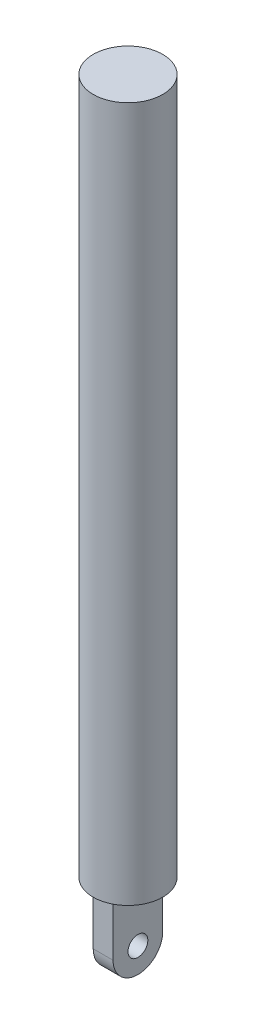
ISO-10303-21;
HEADER;
FILE_DESCRIPTION(('STEP AP214'),'2;1');
FILE_NAME('part.step','',(''),(''),'','','');
FILE_SCHEMA(('AUTOMOTIVE_DESIGN { 1 0 10303 214 1 1 1 1 }'));
ENDSEC;
DATA;
#1=APPLICATION_CONTEXT('core data for automotive mechanical design processes');
#2=APPLICATION_PROTOCOL_DEFINITION('international standard','automotive_design',2000,#1);
#3=PRODUCT_CONTEXT('',#1,'mechanical');
#4=PRODUCT('Part','Part','',(#3));
#5=PRODUCT_RELATED_PRODUCT_CATEGORY('part','',(#4));
#6=PRODUCT_DEFINITION_FORMATION('','',#4);
#7=PRODUCT_DEFINITION_CONTEXT('part definition',#1,'design');
#8=PRODUCT_DEFINITION('design','',#6,#7);
#9=PRODUCT_DEFINITION_SHAPE('','',#8);
#10=(LENGTH_UNIT() NAMED_UNIT(*) SI_UNIT(.MILLI.,.METRE.));
#11=(NAMED_UNIT(*) PLANE_ANGLE_UNIT() SI_UNIT($,.RADIAN.));
#12=(NAMED_UNIT(*) SI_UNIT($,.STERADIAN.) SOLID_ANGLE_UNIT());
#13=UNCERTAINTY_MEASURE_WITH_UNIT(LENGTH_MEASURE(1.E-05),#10,'distance_accuracy_value','');
#14=(GEOMETRIC_REPRESENTATION_CONTEXT(3) GLOBAL_UNCERTAINTY_ASSIGNED_CONTEXT((#13)) GLOBAL_UNIT_ASSIGNED_CONTEXT((#10,
#11,#12)) REPRESENTATION_CONTEXT('',''));
#15=CARTESIAN_POINT('',(0.,0.,0.));
#16=DIRECTION('',(0.,0.,1.));
#17=DIRECTION('',(1.,0.,0.));
#18=AXIS2_PLACEMENT_3D('',#15,#16,#17);
#19=CARTESIAN_POINT('',(0.,0.,0.));
#20=DIRECTION('',(0.,1.,0.));
#21=DIRECTION('',(0.,0.,1.));
#22=AXIS2_PLACEMENT_3D('',#19,#20,#21);
#23=PLANE('',#22);
#24=CARTESIAN_POINT('',(0.,0.,0.));
#25=DIRECTION('',(0.,1.,0.));
#26=DIRECTION('',(0.,0.,1.));
#27=AXIS2_PLACEMENT_3D('',#24,#25,#26);
#28=CIRCLE('',#27,35.);
#29=CARTESIAN_POINT('',(0.,0.,35.));
#30=VERTEX_POINT('',#29);
#31=EDGE_CURVE('E102',#30,#30,#28,.T.);
#32=ORIENTED_EDGE('',*,*,#31,.F.);
#33=EDGE_LOOP('',(#32));
#34=FACE_BOUND('',#33,.T.);
#35=DIRECTION('',(-1.,0.,0.));
#36=VECTOR('',#35,1.);
#37=CARTESIAN_POINT('',(-9.99999999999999,0.,25.));
#38=LINE('',#37,#36);
#39=CARTESIAN_POINT('',(10.,0.,25.));
#40=VERTEX_POINT('',#39);
#41=CARTESIAN_POINT('',(-9.99999999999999,0.,25.));
#42=VERTEX_POINT('',#41);
#43=EDGE_CURVE('E88',#40,#42,#38,.T.);
#44=ORIENTED_EDGE('',*,*,#43,.F.);
#45=DIRECTION('',(0.,0.,-1.));
#46=VECTOR('',#45,1.);
#47=CARTESIAN_POINT('',(10.,0.,25.));
#48=LINE('',#47,#46);
#49=CARTESIAN_POINT('',(10.,0.,-25.));
#50=VERTEX_POINT('',#49);
#51=EDGE_CURVE('E95',#40,#50,#48,.T.);
#52=ORIENTED_EDGE('',*,*,#51,.T.);
#53=DIRECTION('',(-1.,0.,0.));
#54=VECTOR('',#53,1.);
#55=CARTESIAN_POINT('',(-9.99999999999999,0.,-25.));
#56=LINE('',#55,#54);
#57=CARTESIAN_POINT('',(-9.99999999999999,0.,-25.));
#58=VERTEX_POINT('',#57);
#59=EDGE_CURVE('E113',#50,#58,#56,.T.);
#60=ORIENTED_EDGE('',*,*,#59,.T.);
#61=DIRECTION('',(0.,0.,-1.));
#62=VECTOR('',#61,1.);
#63=CARTESIAN_POINT('',(-9.99999999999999,0.,25.));
#64=LINE('',#63,#62);
#65=EDGE_CURVE('E103',#42,#58,#64,.T.);
#66=ORIENTED_EDGE('',*,*,#65,.F.);
#67=EDGE_LOOP('',(#44,#52,#60,#66));
#68=FACE_BOUND('',#67,.T.);
#69=ADVANCED_FACE('F39',(#34,#68),#23,.F.);
#70=CARTESIAN_POINT('',(0.,700.,0.));
#71=DIRECTION('',(0.,-1.,0.));
#72=DIRECTION('',(0.,0.,-1.));
#73=AXIS2_PLACEMENT_3D('',#70,#71,#72);
#74=CYLINDRICAL_SURFACE('',#73,35.);
#75=CARTESIAN_POINT('',(0.,700.,0.));
#76=DIRECTION('',(0.,1.,0.));
#77=DIRECTION('',(0.,0.,1.));
#78=AXIS2_PLACEMENT_3D('',#75,#76,#77);
#79=CIRCLE('',#78,35.);
#80=CARTESIAN_POINT('',(0.,700.,35.));
#81=VERTEX_POINT('',#80);
#82=EDGE_CURVE('E118',#81,#81,#79,.T.);
#83=ORIENTED_EDGE('',*,*,#82,.F.);
#84=EDGE_LOOP('',(#83));
#85=FACE_BOUND('',#84,.T.);
#86=ORIENTED_EDGE('',*,*,#31,.T.);
#87=EDGE_LOOP('',(#86));
#88=FACE_BOUND('',#87,.T.);
#89=ADVANCED_FACE('F155',(#85,#88),#74,.T.);
#90=CARTESIAN_POINT('',(0.,700.,0.));
#91=DIRECTION('',(0.,1.,0.));
#92=DIRECTION('',(0.,0.,1.));
#93=AXIS2_PLACEMENT_3D('',#90,#91,#92);
#94=PLANE('',#93);
#95=ORIENTED_EDGE('',*,*,#82,.T.);
#96=EDGE_LOOP('',(#95));
#97=FACE_BOUND('',#96,.T.);
#98=ADVANCED_FACE('F147',(#97),#94,.T.);
#99=CARTESIAN_POINT('',(10.,-80.,25.));
#100=DIRECTION('',(-1.,0.,0.));
#101=DIRECTION('',(0.,-1.,0.));
#102=AXIS2_PLACEMENT_3D('',#99,#100,#101);
#103=PLANE('',#102);
#104=CARTESIAN_POINT('',(10.,-55.,0.));
#105=DIRECTION('',(1.,0.,0.));
#106=DIRECTION('',(0.,1.,0.));
#107=AXIS2_PLACEMENT_3D('',#104,#105,#106);
#108=CIRCLE('',#107,10.);
#109=CARTESIAN_POINT('',(10.,-45.,0.));
#110=VERTEX_POINT('',#109);
#111=EDGE_CURVE('E136',#110,#110,#108,.T.);
#112=ORIENTED_EDGE('',*,*,#111,.F.);
#113=EDGE_LOOP('',(#112));
#114=FACE_BOUND('',#113,.T.);
#115=CARTESIAN_POINT('',(10.,-55.,0.));
#116=DIRECTION('',(-1.,0.,0.));
#117=DIRECTION('',(0.,-1.,0.));
#118=AXIS2_PLACEMENT_3D('',#115,#116,#117);
#119=CIRCLE('',#118,25.);
#120=CARTESIAN_POINT('',(10.,-55.,25.));
#121=VERTEX_POINT('',#120);
#122=CARTESIAN_POINT('',(10.,-80.,0.));
#123=VERTEX_POINT('',#122);
#124=EDGE_CURVE('E121',#121,#123,#119,.F.);
#125=ORIENTED_EDGE('',*,*,#124,.T.);
#126=CARTESIAN_POINT('',(10.,-55.,0.));
#127=DIRECTION('',(-1.,0.,0.));
#128=DIRECTION('',(0.,-1.,0.));
#129=AXIS2_PLACEMENT_3D('',#126,#127,#128);
#130=CIRCLE('',#129,25.);
#131=CARTESIAN_POINT('',(10.,-55.,-25.));
#132=VERTEX_POINT('',#131);
#133=EDGE_CURVE('E125',#123,#132,#130,.F.);
#134=ORIENTED_EDGE('',*,*,#133,.T.);
#135=DIRECTION('',(0.,1.,0.));
#136=VECTOR('',#135,1.);
#137=CARTESIAN_POINT('',(10.,-80.,-25.));
#138=LINE('',#137,#136);
#139=EDGE_CURVE('E98',#132,#50,#138,.T.);
#140=ORIENTED_EDGE('',*,*,#139,.T.);
#141=ORIENTED_EDGE('',*,*,#51,.F.);
#142=DIRECTION('',(0.,1.,0.));
#143=VECTOR('',#142,1.);
#144=CARTESIAN_POINT('',(10.,-80.,25.));
#145=LINE('',#144,#143);
#146=EDGE_CURVE('E84',#121,#40,#145,.T.);
#147=ORIENTED_EDGE('',*,*,#146,.F.);
#148=EDGE_LOOP('',(#125,#134,#140,#141,#147));
#149=FACE_BOUND('',#148,.T.);
#150=ADVANCED_FACE('F96',(#114,#149),#103,.F.);
#151=CARTESIAN_POINT('',(-9.99999999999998,-80.,25.));
#152=DIRECTION('',(1.,0.,0.));
#153=DIRECTION('',(0.,1.,0.));
#154=AXIS2_PLACEMENT_3D('',#151,#152,#153);
#155=PLANE('',#154);
#156=CARTESIAN_POINT('',(-9.99999999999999,-55.,0.));
#157=DIRECTION('',(1.,0.,0.));
#158=DIRECTION('',(0.,1.,0.));
#159=AXIS2_PLACEMENT_3D('',#156,#157,#158);
#160=CIRCLE('',#159,10.);
#161=CARTESIAN_POINT('',(-9.99999999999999,-45.,0.));
#162=VERTEX_POINT('',#161);
#163=EDGE_CURVE('E43',#162,#162,#160,.T.);
#164=ORIENTED_EDGE('',*,*,#163,.T.);
#165=EDGE_LOOP('',(#164));
#166=FACE_BOUND('',#165,.T.);
#167=DIRECTION('',(0.,-1.,0.));
#168=VECTOR('',#167,1.);
#169=CARTESIAN_POINT('',(-9.99999999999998,-80.,-25.));
#170=LINE('',#169,#168);
#171=CARTESIAN_POINT('',(-9.99999999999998,-55.,-25.));
#172=VERTEX_POINT('',#171);
#173=EDGE_CURVE('E92',#58,#172,#170,.T.);
#174=ORIENTED_EDGE('',*,*,#173,.T.);
#175=CARTESIAN_POINT('',(-9.99999999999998,-55.,0.));
#176=DIRECTION('',(1.,0.,0.));
#177=DIRECTION('',(0.,1.,0.));
#178=AXIS2_PLACEMENT_3D('',#175,#176,#177);
#179=CIRCLE('',#178,25.);
#180=CARTESIAN_POINT('',(-9.99999999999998,-80.,0.));
#181=VERTEX_POINT('',#180);
#182=EDGE_CURVE('E48',#172,#181,#179,.F.);
#183=ORIENTED_EDGE('',*,*,#182,.T.);
#184=CARTESIAN_POINT('',(-9.99999999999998,-55.,0.));
#185=DIRECTION('',(1.,0.,0.));
#186=DIRECTION('',(0.,1.,0.));
#187=AXIS2_PLACEMENT_3D('',#184,#185,#186);
#188=CIRCLE('',#187,25.);
#189=CARTESIAN_POINT('',(-9.99999999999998,-55.,25.));
#190=VERTEX_POINT('',#189);
#191=EDGE_CURVE('E56',#181,#190,#188,.F.);
#192=ORIENTED_EDGE('',*,*,#191,.T.);
#193=DIRECTION('',(0.,-1.,0.));
#194=VECTOR('',#193,1.);
#195=CARTESIAN_POINT('',(-9.99999999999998,-80.,25.));
#196=LINE('',#195,#194);
#197=EDGE_CURVE('E107',#42,#190,#196,.T.);
#198=ORIENTED_EDGE('',*,*,#197,.F.);
#199=ORIENTED_EDGE('',*,*,#65,.T.);
#200=EDGE_LOOP('',(#174,#183,#192,#198,#199));
#201=FACE_BOUND('',#200,.T.);
#202=ADVANCED_FACE('F146',(#166,#201),#155,.F.);
#203=CARTESIAN_POINT('',(0.,0.,25.));
#204=DIRECTION('',(0.,0.,-1.));
#205=DIRECTION('',(-1.,0.,0.));
#206=AXIS2_PLACEMENT_3D('',#203,#204,#205);
#207=PLANE('',#206);
#208=ORIENTED_EDGE('',*,*,#197,.T.);
#209=DIRECTION('',(1.,0.,0.));
#210=VECTOR('',#209,1.);
#211=CARTESIAN_POINT('',(0.,-55.,25.));
#212=LINE('',#211,#210);
#213=EDGE_CURVE('E11',#190,#121,#212,.T.);
#214=ORIENTED_EDGE('',*,*,#213,.T.);
#215=ORIENTED_EDGE('',*,*,#146,.T.);
#216=ORIENTED_EDGE('',*,*,#43,.T.);
#217=EDGE_LOOP('',(#208,#214,#215,#216));
#218=FACE_BOUND('',#217,.T.);
#219=ADVANCED_FACE('F86',(#218),#207,.F.);
#220=CARTESIAN_POINT('',(0.,0.,-25.));
#221=DIRECTION('',(0.,0.,-1.));
#222=DIRECTION('',(-1.,0.,0.));
#223=AXIS2_PLACEMENT_3D('',#220,#221,#222);
#224=PLANE('',#223);
#225=ORIENTED_EDGE('',*,*,#139,.F.);
#226=DIRECTION('',(1.,0.,0.));
#227=VECTOR('',#226,1.);
#228=CARTESIAN_POINT('',(-9.99999999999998,-55.,-25.));
#229=LINE('',#228,#227);
#230=EDGE_CURVE('E127',#132,#172,#229,.F.);
#231=ORIENTED_EDGE('',*,*,#230,.T.);
#232=ORIENTED_EDGE('',*,*,#173,.F.);
#233=ORIENTED_EDGE('',*,*,#59,.F.);
#234=EDGE_LOOP('',(#225,#231,#232,#233));
#235=FACE_BOUND('',#234,.T.);
#236=ADVANCED_FACE('F174',(#235),#224,.T.);
#237=CARTESIAN_POINT('',(0.,-55.,0.));
#238=DIRECTION('',(1.,0.,0.));
#239=DIRECTION('',(0.,0.,-1.));
#240=AXIS2_PLACEMENT_3D('',#237,#238,#239);
#241=CYLINDRICAL_SURFACE('',#240,25.);
#242=ORIENTED_EDGE('',*,*,#213,.F.);
#243=ORIENTED_EDGE('',*,*,#191,.F.);
#244=DIRECTION('',(1.,0.,0.));
#245=VECTOR('',#244,1.);
#246=CARTESIAN_POINT('',(-9.99999999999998,-80.,0.));
#247=LINE('',#246,#245);
#248=EDGE_CURVE('E114',#123,#181,#247,.F.);
#249=ORIENTED_EDGE('',*,*,#248,.F.);
#250=ORIENTED_EDGE('',*,*,#124,.F.);
#251=EDGE_LOOP('',(#242,#243,#249,#250));
#252=FACE_BOUND('',#251,.T.);
#253=ADVANCED_FACE('F41',(#252),#241,.T.);
#254=CARTESIAN_POINT('',(-9.99999999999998,-55.,0.));
#255=DIRECTION('',(-1.,0.,0.));
#256=DIRECTION('',(0.,0.,1.));
#257=AXIS2_PLACEMENT_3D('',#254,#255,#256);
#258=CYLINDRICAL_SURFACE('',#257,25.);
#259=ORIENTED_EDGE('',*,*,#182,.F.);
#260=ORIENTED_EDGE('',*,*,#230,.F.);
#261=ORIENTED_EDGE('',*,*,#133,.F.);
#262=ORIENTED_EDGE('',*,*,#248,.T.);
#263=EDGE_LOOP('',(#259,#260,#261,#262));
#264=FACE_BOUND('',#263,.T.);
#265=ADVANCED_FACE('F168',(#264),#258,.T.);
#266=CARTESIAN_POINT('',(-70.,-55.,0.));
#267=DIRECTION('',(1.,0.,0.));
#268=DIRECTION('',(0.,1.,0.));
#269=AXIS2_PLACEMENT_3D('',#266,#267,#268);
#270=CYLINDRICAL_SURFACE('',#269,10.);
#271=ORIENTED_EDGE('',*,*,#111,.T.);
#272=EDGE_LOOP('',(#271));
#273=FACE_BOUND('',#272,.T.);
#274=ORIENTED_EDGE('',*,*,#163,.F.);
#275=EDGE_LOOP('',(#274));
#276=FACE_BOUND('',#275,.T.);
#277=ADVANCED_FACE('F142',(#273,#276),#270,.F.);
#278=CLOSED_SHELL('',(#69,#89,#98,#150,#202,#219,#236,#253,#265,#277));
#279=MANIFOLD_SOLID_BREP('B2',#278);
#280=ADVANCED_BREP_SHAPE_REPRESENTATION('',(#18,#279),#14);
#281=SHAPE_DEFINITION_REPRESENTATION(#9,#280);
ENDSEC;
END-ISO-10303-21;
